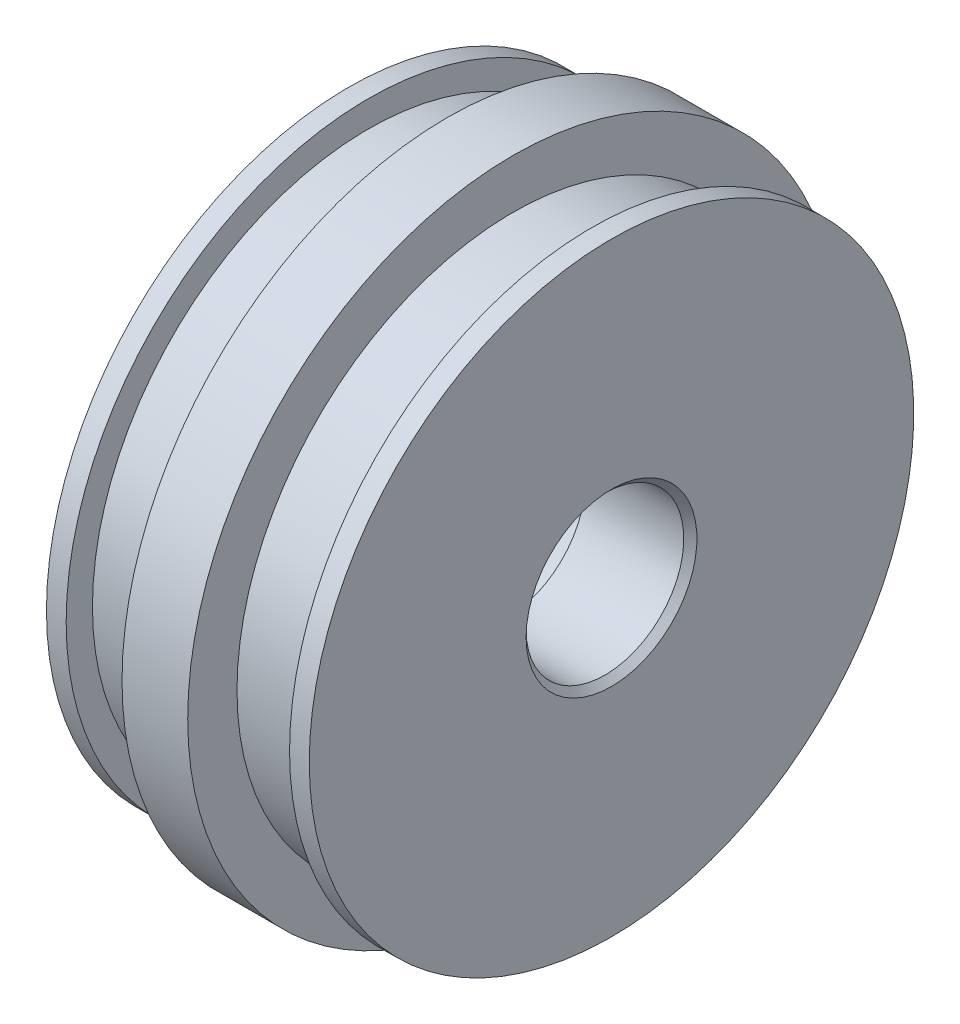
from build123d import *

# Parameters (mm, degrees)
ESQUISSE2_R        = 16
LAMAGE_DEPTH       = 12
CHANFREIN_0_5_SIZE = 0.5


with BuildPart() as part:
    # Esquisse1 → BASE (revolve)
    with BuildSketch(Plane.XY, mode=Mode.PRIVATE) as base_sk:
        Polygon((0, 23), (0, 6), (20, 6), (20, 23), (18.5, 23), (18.5, 21), (12.5, 21), (12.5, 24.75), (7.5, 24.75), (7.5, 21), (1.5, 21), (1.5, 23), align=None)
    revolve(base_sk.sketch.rotate(Axis((0, 0, 0), (1, 0, 0)), 90), axis=Axis((0, 0, 0), (1, 0, 0)))

    # Esquisse2 → LAMAGE (cut)
    with BuildSketch(Plane.ZY):
        Circle(ESQUISSE2_R)
    extrude(amount=-LAMAGE_DEPTH, mode=Mode.SUBTRACT)

    # Chanfrein 0_5
    chanfrein_0_5_edges = [part.edges().sort_by_distance(p)[0] for p in [
        (20, 0, -6),
    ]]
    chamfer(chanfrein_0_5_edges, length=CHANFREIN_0_5_SIZE)


solid = part.part
